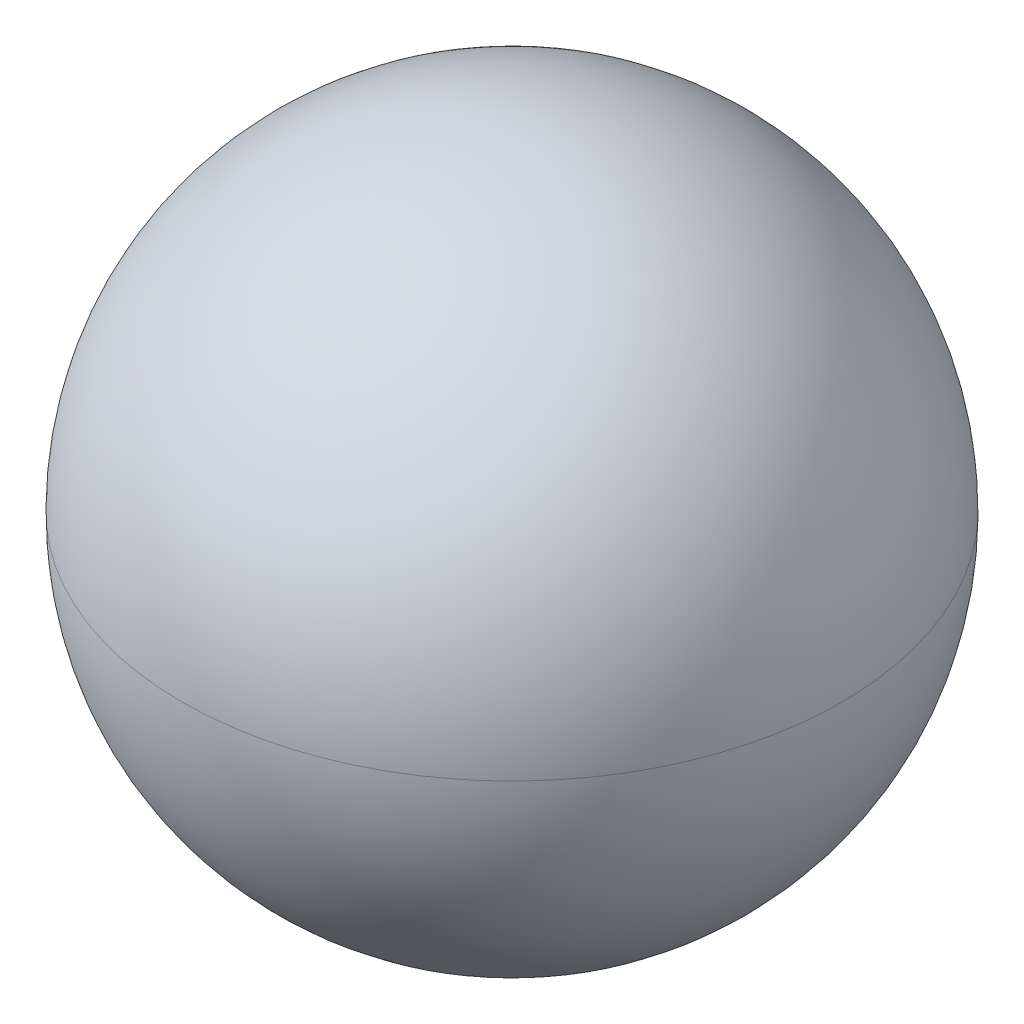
ISO-10303-21;
HEADER;
FILE_DESCRIPTION(('STEP AP214'),'2;1');
FILE_NAME('part.step','',(''),(''),'','','');
FILE_SCHEMA(('AUTOMOTIVE_DESIGN { 1 0 10303 214 1 1 1 1 }'));
ENDSEC;
DATA;
#1=APPLICATION_CONTEXT('core data for automotive mechanical design processes');
#2=APPLICATION_PROTOCOL_DEFINITION('international standard','automotive_design',2000,#1);
#3=PRODUCT_CONTEXT('',#1,'mechanical');
#4=PRODUCT('Part','Part','',(#3));
#5=PRODUCT_RELATED_PRODUCT_CATEGORY('part','',(#4));
#6=PRODUCT_DEFINITION_FORMATION('','',#4);
#7=PRODUCT_DEFINITION_CONTEXT('part definition',#1,'design');
#8=PRODUCT_DEFINITION('design','',#6,#7);
#9=PRODUCT_DEFINITION_SHAPE('','',#8);
#10=(LENGTH_UNIT() NAMED_UNIT(*) SI_UNIT(.MILLI.,.METRE.));
#11=(NAMED_UNIT(*) PLANE_ANGLE_UNIT() SI_UNIT($,.RADIAN.));
#12=(NAMED_UNIT(*) SI_UNIT($,.STERADIAN.) SOLID_ANGLE_UNIT());
#13=UNCERTAINTY_MEASURE_WITH_UNIT(LENGTH_MEASURE(1.E-05),#10,'distance_accuracy_value','');
#14=(GEOMETRIC_REPRESENTATION_CONTEXT(3) GLOBAL_UNCERTAINTY_ASSIGNED_CONTEXT((#13)) GLOBAL_UNIT_ASSIGNED_CONTEXT((#10,
#11,#12)) REPRESENTATION_CONTEXT('',''));
#15=CARTESIAN_POINT('',(0.,0.,0.));
#16=DIRECTION('',(0.,0.,1.));
#17=DIRECTION('',(1.,0.,0.));
#18=AXIS2_PLACEMENT_3D('',#15,#16,#17);
#19=CARTESIAN_POINT('',(0.,20.,0.));
#20=DIRECTION('',(0.,1.,0.));
#21=DIRECTION('',(0.,0.,1.));
#22=AXIS2_PLACEMENT_3D('',#19,#20,#21);
#23=SPHERICAL_SURFACE('',#22,20.);
#24=CARTESIAN_POINT('',(0.,20.,0.));
#25=DIRECTION('',(0.,-1.,0.));
#26=DIRECTION('',(0.,0.,-1.));
#27=AXIS2_PLACEMENT_3D('',#24,#25,#26);
#28=CIRCLE('',#27,20.);
#29=CARTESIAN_POINT('',(0.,20.,-20.));
#30=VERTEX_POINT('',#29);
#31=EDGE_CURVE('E10',#30,#30,#28,.T.);
#32=ORIENTED_EDGE('',*,*,#31,.F.);
#33=EDGE_LOOP('',(#32));
#34=FACE_BOUND('',#33,.T.);
#35=ADVANCED_FACE('F37',(#34),#23,.T.);
#36=CARTESIAN_POINT('',(0.,20.,0.));
#37=DIRECTION('',(0.,1.,0.));
#38=DIRECTION('',(0.,0.,1.));
#39=AXIS2_PLACEMENT_3D('',#36,#37,#38);
#40=SPHERICAL_SURFACE('',#39,20.);
#41=ORIENTED_EDGE('',*,*,#31,.T.);
#42=EDGE_LOOP('',(#41));
#43=FACE_BOUND('',#42,.T.);
#44=ADVANCED_FACE('F45',(#43),#40,.T.);
#45=CLOSED_SHELL('',(#35,#44));
#46=MANIFOLD_SOLID_BREP('B2',#45);
#47=ADVANCED_BREP_SHAPE_REPRESENTATION('',(#18,#46),#14);
#48=SHAPE_DEFINITION_REPRESENTATION(#9,#47);
ENDSEC;
END-ISO-10303-21;
